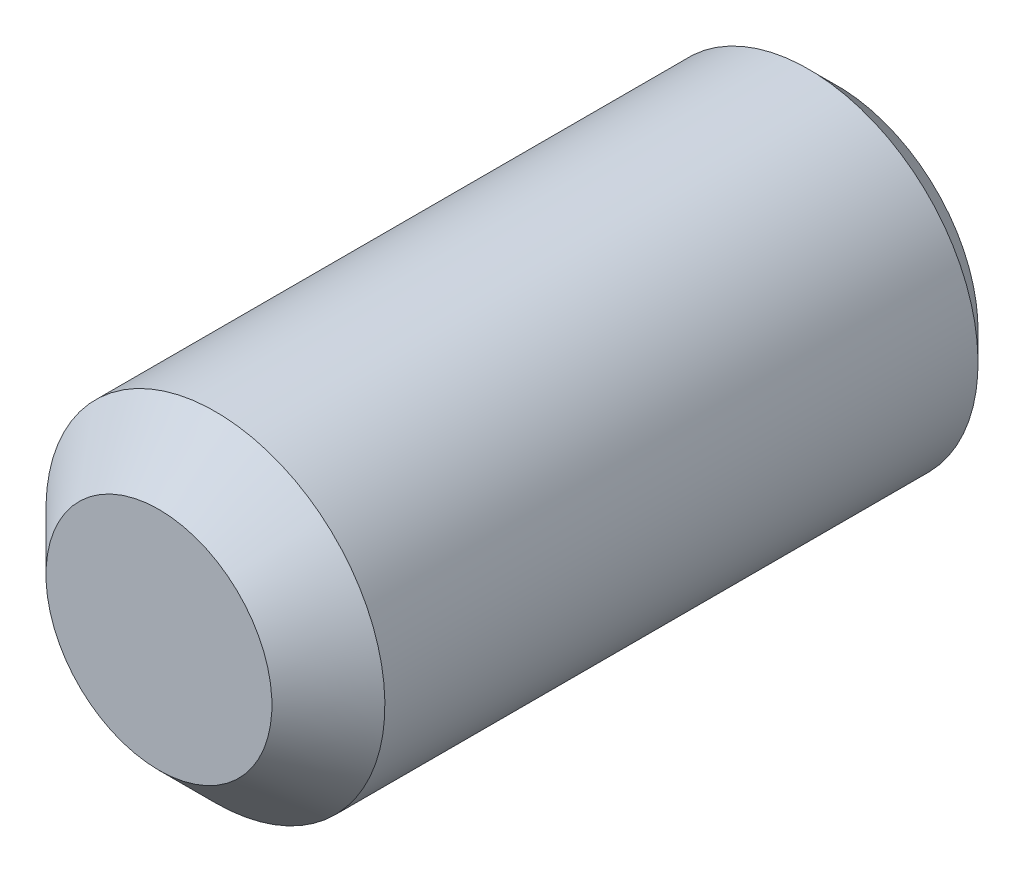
from build123d import *

# Parameters (mm, degrees)
CUT_EXTRUDE1_DEPTH = 3.5


with BuildPart() as part:
    # Sketch1 → Revolve1 (revolve)
    with BuildSketch(Plane(origin=(0, 0, 0), x_dir=(0, 0, -1), z_dir=(1, 0, 0)), mode=Mode.PRIVATE) as revolve1_sk:
        Polygon((-12, 0), (-4.401290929, 0), (-3.5, 1.5), (0, 1.5), (0, 2.49), (-11.495857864, 2.49), (-11.485857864, 2.5), (0, 2.5), (-0.5, 3), (-11, 3), (-12, 2), align=None)
    revolve(revolve1_sk.sketch.rotate(Axis((0, 0, 4.401290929), (0, 0, -1)), 180), axis=Axis((0, 0, 4.401290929), (0, 0, -1)))

    # Sketch2 → Cut-Extrude1 (cut)
    with BuildSketch(Plane(origin=(0, 0, 0), x_dir=(-1, 0, 0), z_dir=(0, 0, -1))):
        Polygon((0.866025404, -1.5), (1.732050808, 0), (0.866025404, 1.5), (-0.866025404, 1.5), (-1.732050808, 0), (-0.866025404, -1.5), align=None)
    extrude(amount=-CUT_EXTRUDE1_DEPTH, mode=Mode.SUBTRACT)


solid = part.part
